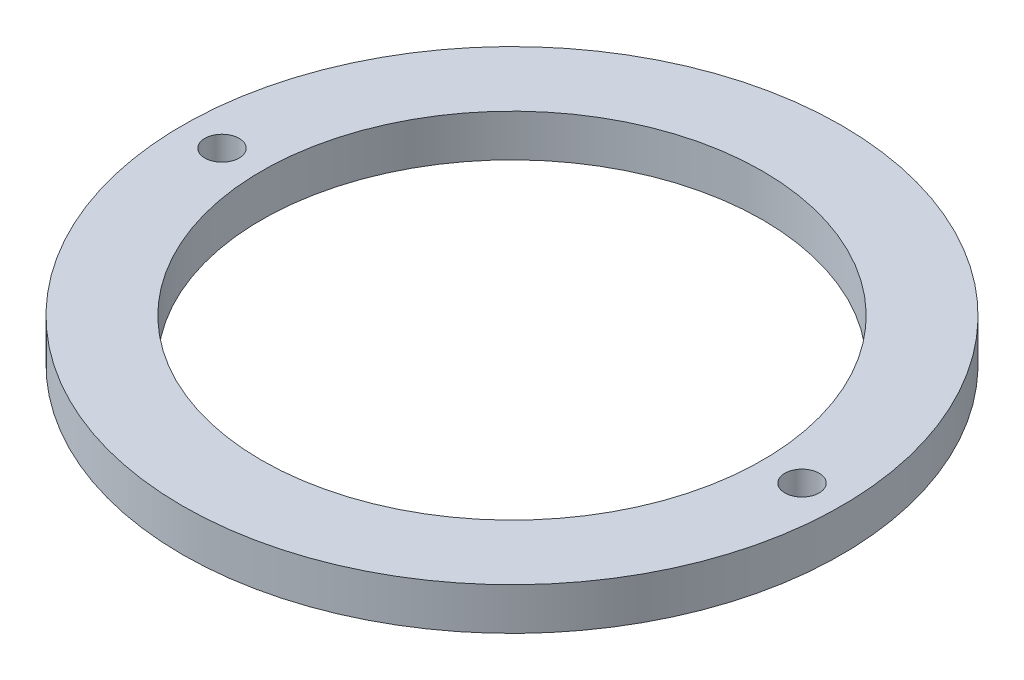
ISO-10303-21;
HEADER;
FILE_DESCRIPTION(('STEP AP214'),'2;1');
FILE_NAME('part.step','',(''),(''),'','','');
FILE_SCHEMA(('AUTOMOTIVE_DESIGN { 1 0 10303 214 1 1 1 1 }'));
ENDSEC;
DATA;
#1=APPLICATION_CONTEXT('core data for automotive mechanical design processes');
#2=APPLICATION_PROTOCOL_DEFINITION('international standard','automotive_design',2000,#1);
#3=PRODUCT_CONTEXT('',#1,'mechanical');
#4=PRODUCT('Part','Part','',(#3));
#5=PRODUCT_RELATED_PRODUCT_CATEGORY('part','',(#4));
#6=PRODUCT_DEFINITION_FORMATION('','',#4);
#7=PRODUCT_DEFINITION_CONTEXT('part definition',#1,'design');
#8=PRODUCT_DEFINITION('design','',#6,#7);
#9=PRODUCT_DEFINITION_SHAPE('','',#8);
#10=(LENGTH_UNIT() NAMED_UNIT(*) SI_UNIT(.MILLI.,.METRE.));
#11=(NAMED_UNIT(*) PLANE_ANGLE_UNIT() SI_UNIT($,.RADIAN.));
#12=(NAMED_UNIT(*) SI_UNIT($,.STERADIAN.) SOLID_ANGLE_UNIT());
#13=UNCERTAINTY_MEASURE_WITH_UNIT(LENGTH_MEASURE(1.E-05),#10,'distance_accuracy_value','');
#14=(GEOMETRIC_REPRESENTATION_CONTEXT(3) GLOBAL_UNCERTAINTY_ASSIGNED_CONTEXT((#13)) GLOBAL_UNIT_ASSIGNED_CONTEXT((#10,
#11,#12)) REPRESENTATION_CONTEXT('',''));
#15=CARTESIAN_POINT('',(0.,0.,0.));
#16=DIRECTION('',(0.,0.,1.));
#17=DIRECTION('',(1.,0.,0.));
#18=AXIS2_PLACEMENT_3D('',#15,#16,#17);
#19=CARTESIAN_POINT('',(0.,8.,0.));
#20=DIRECTION('',(0.,1.,0.));
#21=DIRECTION('',(0.,0.,1.));
#22=AXIS2_PLACEMENT_3D('',#19,#20,#21);
#23=PLANE('',#22);
#24=CARTESIAN_POINT('',(-55.,8.,0.));
#25=DIRECTION('',(0.,1.,0.));
#26=DIRECTION('',(0.,0.,1.));
#27=AXIS2_PLACEMENT_3D('',#24,#25,#26);
#28=CIRCLE('',#27,3.25);
#29=CARTESIAN_POINT('',(-55.,8.,3.25));
#30=VERTEX_POINT('',#29);
#31=EDGE_CURVE('E30',#30,#30,#28,.T.);
#32=ORIENTED_EDGE('',*,*,#31,.F.);
#33=EDGE_LOOP('',(#32));
#34=FACE_BOUND('',#33,.T.);
#35=CARTESIAN_POINT('',(0.,8.,0.));
#36=DIRECTION('',(0.,1.,0.));
#37=DIRECTION('',(0.,0.,1.));
#38=AXIS2_PLACEMENT_3D('',#35,#36,#37);
#39=CIRCLE('',#38,62.5);
#40=CARTESIAN_POINT('',(0.,8.,62.5));
#41=VERTEX_POINT('',#40);
#42=EDGE_CURVE('E9',#41,#41,#39,.T.);
#43=ORIENTED_EDGE('',*,*,#42,.T.);
#44=EDGE_LOOP('',(#43));
#45=FACE_BOUND('',#44,.T.);
#46=CARTESIAN_POINT('',(0.,8.,0.));
#47=DIRECTION('',(0.,1.,0.));
#48=DIRECTION('',(0.,0.,1.));
#49=AXIS2_PLACEMENT_3D('',#46,#47,#48);
#50=CIRCLE('',#49,47.5);
#51=CARTESIAN_POINT('',(0.,8.,47.5));
#52=VERTEX_POINT('',#51);
#53=EDGE_CURVE('E25',#52,#52,#50,.T.);
#54=ORIENTED_EDGE('',*,*,#53,.F.);
#55=EDGE_LOOP('',(#54));
#56=FACE_BOUND('',#55,.T.);
#57=CARTESIAN_POINT('',(55.,8.,0.));
#58=DIRECTION('',(0.,1.,0.));
#59=DIRECTION('',(0.,0.,1.));
#60=AXIS2_PLACEMENT_3D('',#57,#58,#59);
#61=CIRCLE('',#60,3.25);
#62=CARTESIAN_POINT('',(55.,8.,3.25));
#63=VERTEX_POINT('',#62);
#64=EDGE_CURVE('E36',#63,#63,#61,.T.);
#65=ORIENTED_EDGE('',*,*,#64,.F.);
#66=EDGE_LOOP('',(#65));
#67=FACE_BOUND('',#66,.T.);
#68=ADVANCED_FACE('F14',(#34,#45,#56,#67),#23,.T.);
#69=CARTESIAN_POINT('',(0.,0.,0.));
#70=DIRECTION('',(0.,1.,0.));
#71=DIRECTION('',(0.,0.,1.));
#72=AXIS2_PLACEMENT_3D('',#69,#70,#71);
#73=PLANE('',#72);
#74=CARTESIAN_POINT('',(0.,0.,0.));
#75=DIRECTION('',(0.,1.,0.));
#76=DIRECTION('',(0.,0.,1.));
#77=AXIS2_PLACEMENT_3D('',#74,#75,#76);
#78=CIRCLE('',#77,62.5);
#79=CARTESIAN_POINT('',(0.,0.,62.5));
#80=VERTEX_POINT('',#79);
#81=EDGE_CURVE('E18',#80,#80,#78,.T.);
#82=ORIENTED_EDGE('',*,*,#81,.F.);
#83=EDGE_LOOP('',(#82));
#84=FACE_BOUND('',#83,.T.);
#85=CARTESIAN_POINT('',(0.,0.,0.));
#86=DIRECTION('',(0.,1.,0.));
#87=DIRECTION('',(0.,0.,1.));
#88=AXIS2_PLACEMENT_3D('',#85,#86,#87);
#89=CIRCLE('',#88,47.5);
#90=CARTESIAN_POINT('',(0.,0.,47.5));
#91=VERTEX_POINT('',#90);
#92=EDGE_CURVE('E27',#91,#91,#89,.T.);
#93=ORIENTED_EDGE('',*,*,#92,.T.);
#94=EDGE_LOOP('',(#93));
#95=FACE_BOUND('',#94,.T.);
#96=CARTESIAN_POINT('',(-55.,0.,0.));
#97=DIRECTION('',(0.,1.,0.));
#98=DIRECTION('',(0.,0.,1.));
#99=AXIS2_PLACEMENT_3D('',#96,#97,#98);
#100=CIRCLE('',#99,3.25);
#101=CARTESIAN_POINT('',(-55.,0.,3.25));
#102=VERTEX_POINT('',#101);
#103=EDGE_CURVE('E33',#102,#102,#100,.T.);
#104=ORIENTED_EDGE('',*,*,#103,.T.);
#105=EDGE_LOOP('',(#104));
#106=FACE_BOUND('',#105,.T.);
#107=CARTESIAN_POINT('',(55.,0.,0.));
#108=DIRECTION('',(0.,1.,0.));
#109=DIRECTION('',(0.,0.,1.));
#110=AXIS2_PLACEMENT_3D('',#107,#108,#109);
#111=CIRCLE('',#110,3.25);
#112=CARTESIAN_POINT('',(55.,0.,3.25));
#113=VERTEX_POINT('',#112);
#114=EDGE_CURVE('E39',#113,#113,#111,.T.);
#115=ORIENTED_EDGE('',*,*,#114,.T.);
#116=EDGE_LOOP('',(#115));
#117=FACE_BOUND('',#116,.T.);
#118=ADVANCED_FACE('F49',(#84,#95,#106,#117),#73,.F.);
#119=CARTESIAN_POINT('',(0.,8.,0.));
#120=DIRECTION('',(0.,-1.,0.));
#121=DIRECTION('',(0.,0.,-1.));
#122=AXIS2_PLACEMENT_3D('',#119,#120,#121);
#123=CYLINDRICAL_SURFACE('',#122,62.5);
#124=ORIENTED_EDGE('',*,*,#42,.F.);
#125=EDGE_LOOP('',(#124));
#126=FACE_BOUND('',#125,.T.);
#127=ORIENTED_EDGE('',*,*,#81,.T.);
#128=EDGE_LOOP('',(#127));
#129=FACE_BOUND('',#128,.T.);
#130=ADVANCED_FACE('F16',(#126,#129),#123,.T.);
#131=CARTESIAN_POINT('',(0.,8.,0.));
#132=DIRECTION('',(0.,-1.,0.));
#133=DIRECTION('',(0.,0.,-1.));
#134=AXIS2_PLACEMENT_3D('',#131,#132,#133);
#135=CYLINDRICAL_SURFACE('',#134,47.5);
#136=ORIENTED_EDGE('',*,*,#53,.T.);
#137=EDGE_LOOP('',(#136));
#138=FACE_BOUND('',#137,.T.);
#139=ORIENTED_EDGE('',*,*,#92,.F.);
#140=EDGE_LOOP('',(#139));
#141=FACE_BOUND('',#140,.T.);
#142=ADVANCED_FACE('F60',(#138,#141),#135,.F.);
#143=CARTESIAN_POINT('',(-55.,8.,0.));
#144=DIRECTION('',(0.,-1.,0.));
#145=DIRECTION('',(0.,0.,-1.));
#146=AXIS2_PLACEMENT_3D('',#143,#144,#145);
#147=CYLINDRICAL_SURFACE('',#146,3.25);
#148=ORIENTED_EDGE('',*,*,#31,.T.);
#149=EDGE_LOOP('',(#148));
#150=FACE_BOUND('',#149,.T.);
#151=ORIENTED_EDGE('',*,*,#103,.F.);
#152=EDGE_LOOP('',(#151));
#153=FACE_BOUND('',#152,.T.);
#154=ADVANCED_FACE('F63',(#150,#153),#147,.F.);
#155=CARTESIAN_POINT('',(55.,8.,0.));
#156=DIRECTION('',(0.,-1.,0.));
#157=DIRECTION('',(0.,0.,-1.));
#158=AXIS2_PLACEMENT_3D('',#155,#156,#157);
#159=CYLINDRICAL_SURFACE('',#158,3.25);
#160=ORIENTED_EDGE('',*,*,#64,.T.);
#161=EDGE_LOOP('',(#160));
#162=FACE_BOUND('',#161,.T.);
#163=ORIENTED_EDGE('',*,*,#114,.F.);
#164=EDGE_LOOP('',(#163));
#165=FACE_BOUND('',#164,.T.);
#166=ADVANCED_FACE('F45',(#162,#165),#159,.F.);
#167=CLOSED_SHELL('',(#68,#118,#130,#142,#154,#166));
#168=MANIFOLD_SOLID_BREP('B1',#167);
#169=ADVANCED_BREP_SHAPE_REPRESENTATION('',(#18,#168),#14);
#170=SHAPE_DEFINITION_REPRESENTATION(#9,#169);
ENDSEC;
END-ISO-10303-21;
